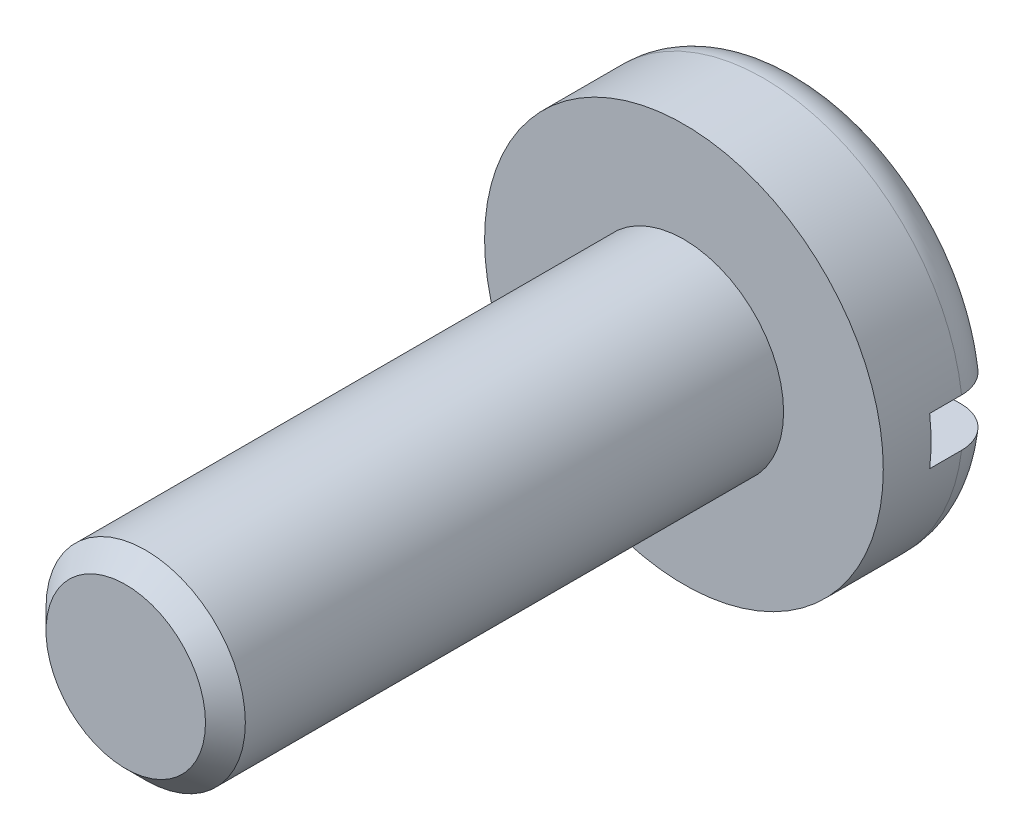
ISO-10303-21;
HEADER;
FILE_DESCRIPTION(('STEP AP214'),'2;1');
FILE_NAME('part.step','',(''),(''),'','','');
FILE_SCHEMA(('AUTOMOTIVE_DESIGN { 1 0 10303 214 1 1 1 1 }'));
ENDSEC;
DATA;
#1=APPLICATION_CONTEXT('core data for automotive mechanical design processes');
#2=APPLICATION_PROTOCOL_DEFINITION('international standard','automotive_design',2000,#1);
#3=PRODUCT_CONTEXT('',#1,'mechanical');
#4=PRODUCT('Part','Part','',(#3));
#5=PRODUCT_RELATED_PRODUCT_CATEGORY('part','',(#4));
#6=PRODUCT_DEFINITION_FORMATION('','',#4);
#7=PRODUCT_DEFINITION_CONTEXT('part definition',#1,'design');
#8=PRODUCT_DEFINITION('design','',#6,#7);
#9=PRODUCT_DEFINITION_SHAPE('','',#8);
#10=(LENGTH_UNIT() NAMED_UNIT(*) SI_UNIT(.MILLI.,.METRE.));
#11=(NAMED_UNIT(*) PLANE_ANGLE_UNIT() SI_UNIT($,.RADIAN.));
#12=(NAMED_UNIT(*) SI_UNIT($,.STERADIAN.) SOLID_ANGLE_UNIT());
#13=UNCERTAINTY_MEASURE_WITH_UNIT(LENGTH_MEASURE(1.E-05),#10,'distance_accuracy_value','');
#14=(GEOMETRIC_REPRESENTATION_CONTEXT(3) GLOBAL_UNCERTAINTY_ASSIGNED_CONTEXT((#13)) GLOBAL_UNIT_ASSIGNED_CONTEXT((#10,
#11,#12)) REPRESENTATION_CONTEXT('',''));
#15=CARTESIAN_POINT('',(0.,0.,0.));
#16=DIRECTION('',(0.,0.,1.));
#17=DIRECTION('',(1.,0.,0.));
#18=AXIS2_PLACEMENT_3D('',#15,#16,#17);
#19=CARTESIAN_POINT('',(0.,0.,-1.49999999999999));
#20=DIRECTION('',(0.,0.,1.));
#21=DIRECTION('',(1.,0.,0.));
#22=AXIS2_PLACEMENT_3D('',#19,#20,#21);
#23=PLANE('',#22);
#24=DIRECTION('',(1.,0.,0.));
#25=VECTOR('',#24,1.);
#26=CARTESIAN_POINT('',(-2.50000000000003,-0.299999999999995,-1.50000000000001));
#27=LINE('',#26,#25);
#28=CARTESIAN_POINT('',(-1.97737199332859,-0.300000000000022,-1.5));
#29=VERTEX_POINT('',#28);
#30=CARTESIAN_POINT('',(1.97737199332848,-0.300000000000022,-1.50000000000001));
#31=VERTEX_POINT('',#30);
#32=EDGE_CURVE('E159',#29,#31,#27,.T.);
#33=ORIENTED_EDGE('',*,*,#32,.T.);
#34=CARTESIAN_POINT('',(0.,0.,-1.49999999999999));
#35=DIRECTION('',(0.,0.,-1.));
#36=DIRECTION('',(-1.,0.,0.));
#37=AXIS2_PLACEMENT_3D('',#34,#35,#36);
#38=CIRCLE('',#37,2.);
#39=EDGE_CURVE('E111',#31,#29,#38,.T.);
#40=ORIENTED_EDGE('',*,*,#39,.T.);
#41=EDGE_LOOP('',(#33,#40));
#42=FACE_BOUND('',#41,.T.);
#43=ADVANCED_FACE('F30',(#42),#23,.F.);
#44=DIRECTION('',(-1.,0.,0.));
#45=VECTOR('',#44,1.);
#46=CARTESIAN_POINT('',(-2.5,0.299999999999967,-1.49999999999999));
#47=LINE('',#46,#45);
#48=CARTESIAN_POINT('',(1.97737199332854,0.299999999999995,-1.5));
#49=VERTEX_POINT('',#48);
#50=CARTESIAN_POINT('',(-1.97737199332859,0.299999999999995,-1.5));
#51=VERTEX_POINT('',#50);
#52=EDGE_CURVE('E96',#49,#51,#47,.T.);
#53=ORIENTED_EDGE('',*,*,#52,.T.);
#54=EDGE_CURVE('E107',#51,#49,#38,.T.);
#55=ORIENTED_EDGE('',*,*,#54,.T.);
#56=EDGE_LOOP('',(#53,#55));
#57=FACE_BOUND('',#56,.T.);
#58=ADVANCED_FACE('F153',(#57),#23,.F.);
#59=CARTESIAN_POINT('',(0.,0.,-1.));
#60=DIRECTION('',(0.,0.,-1.));
#61=DIRECTION('',(-1.,0.,0.));
#62=AXIS2_PLACEMENT_3D('',#59,#60,#61);
#63=TOROIDAL_SURFACE('',#62,2.,0.5);
#64=CARTESIAN_POINT('',(-2.39275623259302,-0.300000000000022,-1.28403566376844));
#65=CARTESIAN_POINT('',(-2.40871742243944,-0.300000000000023,-1.26108979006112));
#66=CARTESIAN_POINT('',(-2.42275912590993,-0.300000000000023,-1.23678491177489));
#67=CARTESIAN_POINT('',(-2.44657688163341,-0.300000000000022,-1.18614419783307));
#68=CARTESIAN_POINT('',(-2.45634810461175,-0.300000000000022,-1.15980610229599));
#69=CARTESIAN_POINT('',(-2.47132091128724,-0.300000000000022,-1.10586746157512));
#70=CARTESIAN_POINT('',(-2.47652391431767,-0.300000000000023,-1.07826731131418));
#71=CARTESIAN_POINT('',(-2.4822090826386,-0.300000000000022,-1.02259204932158));
#72=CARTESIAN_POINT('',(-2.48269236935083,-0.300000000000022,-0.994517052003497));
#73=CARTESIAN_POINT('',(-2.47893141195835,-0.300000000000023,-0.938745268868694));
#74=CARTESIAN_POINT('',(-2.47469714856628,-0.300000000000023,-0.911047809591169));
#75=CARTESIAN_POINT('',(-2.46164113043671,-0.300000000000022,-0.856755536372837));
#76=CARTESIAN_POINT('',(-2.45281923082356,-0.300000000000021,-0.830160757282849));
#77=CARTESIAN_POINT('',(-2.43083915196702,-0.300000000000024,-0.77880928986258));
#78=CARTESIAN_POINT('',(-2.41767832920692,-0.30000000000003,-0.754053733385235));
#79=CARTESIAN_POINT('',(-2.38740458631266,-0.300000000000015,-0.707090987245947));
#80=CARTESIAN_POINT('',(-2.37029161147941,-0.299999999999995,-0.684883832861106));
#81=CARTESIAN_POINT('',(-2.33252347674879,-0.299999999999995,-0.643540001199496));
#82=CARTESIAN_POINT('',(-2.31185310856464,-0.300000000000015,-0.624417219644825));
#83=CARTESIAN_POINT('',(-2.26761601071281,-0.30000000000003,-0.589882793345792));
#84=CARTESIAN_POINT('',(-2.24404918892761,-0.300000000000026,-0.574471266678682));
#85=CARTESIAN_POINT('',(-2.19450129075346,-0.300000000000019,-0.547670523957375));
#86=CARTESIAN_POINT('',(-2.16850345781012,-0.300000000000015,-0.536312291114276));
#87=CARTESIAN_POINT('',(-2.11498123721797,-0.30000000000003,-0.518077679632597));
#88=CARTESIAN_POINT('',(-2.08745677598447,-0.300000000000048,-0.511201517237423));
#89=CARTESIAN_POINT('',(-2.03139586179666,-0.300000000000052,-0.502061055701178));
#90=CARTESIAN_POINT('',(-2.00285249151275,-0.300000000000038,-0.499839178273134));
#91=CARTESIAN_POINT('',(-1.94579410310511,-0.300000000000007,-0.500178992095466));
#92=CARTESIAN_POINT('',(-1.91727908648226,-0.299999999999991,-0.502740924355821));
#93=CARTESIAN_POINT('',(-1.86085138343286,-0.299999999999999,-0.512606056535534));
#94=CARTESIAN_POINT('',(-1.83294512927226,-0.300000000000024,-0.519946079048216));
#95=CARTESIAN_POINT('',(-1.77875489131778,-0.300000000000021,-0.539195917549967));
#96=CARTESIAN_POINT('',(-1.75247096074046,-0.299999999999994,-0.551105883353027));
#97=CARTESIAN_POINT('',(-1.70222054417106,-0.299999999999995,-0.579200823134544));
#98=CARTESIAN_POINT('',(-1.67825918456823,-0.300000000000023,-0.59539497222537));
#99=CARTESIAN_POINT('',(-1.63342077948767,-0.300000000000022,-0.631604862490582));
#100=CARTESIAN_POINT('',(-1.6125436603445,-0.299999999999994,-0.651620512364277));
#101=CARTESIAN_POINT('',(-1.57465426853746,-0.299999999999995,-0.694753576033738));
#102=CARTESIAN_POINT('',(-1.55761348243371,-0.300000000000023,-0.717845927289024));
#103=CARTESIAN_POINT('',(-1.52772834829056,-0.300000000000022,-0.766603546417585));
#104=CARTESIAN_POINT('',(-1.51488357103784,-0.299999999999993,-0.792268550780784));
#105=CARTESIAN_POINT('',(-1.49398926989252,-0.299999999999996,-0.844983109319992));
#106=CARTESIAN_POINT('',(-1.48586286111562,-0.300000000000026,-0.872002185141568));
#107=CARTESIAN_POINT('',(-1.47434461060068,-0.300000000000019,-0.927030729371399));
#108=CARTESIAN_POINT('',(-1.47095224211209,-0.299999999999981,-0.95504008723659));
#109=CARTESIAN_POINT('',(-1.46903184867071,-0.299999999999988,-1.01077570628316));
#110=CARTESIAN_POINT('',(-1.47042704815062,-0.300000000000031,-1.03849935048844));
#111=CARTESIAN_POINT('',(-1.47786557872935,-0.300000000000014,-1.09331475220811));
#112=CARTESIAN_POINT('',(-1.48390879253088,-0.299999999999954,-1.12040652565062));
#113=CARTESIAN_POINT('',(-1.50042579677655,-0.299999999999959,-1.17312973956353));
#114=CARTESIAN_POINT('',(-1.51088885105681,-0.300000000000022,-1.19876454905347));
#115=CARTESIAN_POINT('',(-1.53591625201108,-0.300000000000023,-1.24794598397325));
#116=CARTESIAN_POINT('',(-1.55048084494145,-0.29999999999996,-1.27149248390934));
#117=CARTESIAN_POINT('',(-1.58348986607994,-0.299999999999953,-1.31616342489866));
#118=CARTESIAN_POINT('',(-1.60198226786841,-0.300000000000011,-1.33725240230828));
#119=CARTESIAN_POINT('',(-1.64218916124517,-0.300000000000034,-1.37609462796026));
#120=CARTESIAN_POINT('',(-1.66390395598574,-0.3,-1.39384756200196));
#121=CARTESIAN_POINT('',(-1.71035693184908,-0.299999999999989,-1.4258412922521));
#122=CARTESIAN_POINT('',(-1.7351420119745,-0.300000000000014,-1.4400140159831));
#123=CARTESIAN_POINT('',(-1.78672025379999,-0.300000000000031,-1.46405146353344));
#124=CARTESIAN_POINT('',(-1.81351355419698,-0.300000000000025,-1.4739158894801));
#125=CARTESIAN_POINT('',(-1.86867354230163,-0.30000000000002,-1.489154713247));
#126=CARTESIAN_POINT('',(-1.8970545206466,-0.300000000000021,-1.494477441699));
#127=CARTESIAN_POINT('',(-1.95430672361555,-0.300000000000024,-1.50028825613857));
#128=CARTESIAN_POINT('',(-1.98317793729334,-0.300000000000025,-1.50077644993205));
#129=CARTESIAN_POINT('',(-2.04061759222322,-0.30000000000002,-1.49688950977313));
#130=CARTESIAN_POINT('',(-2.06918574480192,-0.300000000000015,-1.492510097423));
#131=CARTESIAN_POINT('',(-2.12517926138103,-0.30000000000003,-1.47898432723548));
#132=CARTESIAN_POINT('',(-2.1526043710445,-0.30000000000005,-1.46983691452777));
#133=CARTESIAN_POINT('',(-2.20534590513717,-0.30000000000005,-1.44708782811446));
#134=CARTESIAN_POINT('',(-2.23067381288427,-0.30000000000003,-1.43351274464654));
#135=CARTESIAN_POINT('',(-2.27863868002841,-0.300000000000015,-1.4022736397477));
#136=CARTESIAN_POINT('',(-2.30127897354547,-0.300000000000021,-1.38461476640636));
#137=CARTESIAN_POINT('',(-2.33540475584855,-0.300000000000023,-1.35296400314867));
#138=CARTESIAN_POINT('',(-2.34790755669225,-0.300000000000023,-1.34005040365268));
#139=CARTESIAN_POINT('',(-2.37145637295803,-0.300000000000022,-1.31295671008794));
#140=CARTESIAN_POINT('',(-2.38250239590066,-0.300000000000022,-1.29877662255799));
#141=CARTESIAN_POINT('',(-2.39275623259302,-0.300000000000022,-1.28403566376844));
#142=B_SPLINE_CURVE_WITH_KNOTS('',3,(#64,#65,#66,#67,#68,#69,#70,#71,#72,#73,#74,#75,#76,#77,
#78,#79,#80,#81,#82,#83,#84,#85,#86,#87,#88,#89,#90,#91,#92,#93,#94,#95,#96,#97,#98,#99,#100,
#101,#102,#103,#104,#105,#106,#107,#108,#109,#110,#111,#112,#113,#114,#115,#116,#117,#118,#119,
#120,#121,#122,#123,#124,#125,#126,#127,#128,#129,#130,#131,#132,#133,#134,#135,#136,#137,#138,
#139,#140,#141),.UNSPECIFIED.,.T.,.F.,(4,2,2,2,2,2,2,2,2,2,2,2,2,2,2,2,2,2,2,2,2,2,2,2,2,2,2,2,
2,2,2,2,2,2,2,2,2,2,4),(0.,0.0837885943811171,0.16767169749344,0.251528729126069,
0.335365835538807,0.419025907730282,0.502688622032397,0.586402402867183,0.670117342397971,
0.754199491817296,0.83828431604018,0.922998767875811,1.00771730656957,1.09320471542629,
1.17869643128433,1.26485492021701,1.3510162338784,1.43736358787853,1.52370887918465,
1.60938950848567,1.69506137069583,1.77929492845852,1.86351911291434,1.9463989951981,
2.0292767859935,2.11195440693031,2.19463699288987,2.27839438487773,2.36215966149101,
2.44741457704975,2.5326753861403,2.61889371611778,2.70511012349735,2.79140237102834,
2.87771371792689,2.96351598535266,3.0492106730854,3.10303867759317,3.15686640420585),.UNSPECIFIED.);
#143=CARTESIAN_POINT('',(-2.48193472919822,-0.300000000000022,-1.00000000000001));
#144=VERTEX_POINT('',#143);
#145=EDGE_CURVE('E51',#29,#144,#142,.T.);
#146=ORIENTED_EDGE('',*,*,#145,.F.);
#147=ORIENTED_EDGE('',*,*,#39,.F.);
#148=CARTESIAN_POINT('',(1.51295371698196,-0.299999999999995,-1.20152293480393));
#149=CARTESIAN_POINT('',(1.50164195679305,-0.299999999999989,-1.1763253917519));
#150=CARTESIAN_POINT('',(1.49243193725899,-0.300000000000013,-1.15016423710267));
#151=CARTESIAN_POINT('',(1.47852371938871,-0.300000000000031,-1.09664823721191));
#152=CARTESIAN_POINT('',(1.47383003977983,-0.300000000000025,-1.06929222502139));
#153=CARTESIAN_POINT('',(1.46911958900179,-0.30000000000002,-1.01418191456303));
#154=CARTESIAN_POINT('',(1.46910208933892,-0.300000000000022,-0.986427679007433));
#155=CARTESIAN_POINT('',(1.47374385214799,-0.300000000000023,-0.93132004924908));
#156=CARTESIAN_POINT('',(1.47840213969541,-0.300000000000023,-0.903966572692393));
#157=CARTESIAN_POINT('',(1.4922206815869,-0.300000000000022,-0.850505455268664));
#158=CARTESIAN_POINT('',(1.50136823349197,-0.300000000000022,-0.824394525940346));
#159=CARTESIAN_POINT('',(1.52387003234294,-0.300000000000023,-0.774053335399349));
#160=CARTESIAN_POINT('',(1.53722462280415,-0.300000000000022,-0.74982322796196));
#161=CARTESIAN_POINT('',(1.56790637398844,-0.300000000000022,-0.703634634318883));
#162=CARTESIAN_POINT('',(1.58527611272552,-0.300000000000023,-0.6817044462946));
#163=CARTESIAN_POINT('',(1.62339117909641,-0.300000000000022,-0.641006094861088));
#164=CARTESIAN_POINT('',(1.64413681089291,-0.300000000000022,-0.622238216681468));
#165=CARTESIAN_POINT('',(1.68881591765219,-0.300000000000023,-0.588044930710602));
#166=CARTESIAN_POINT('',(1.7127998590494,-0.300000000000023,-0.572685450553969));
#167=CARTESIAN_POINT('',(1.76298083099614,-0.300000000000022,-0.546151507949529));
#168=CARTESIAN_POINT('',(1.78917802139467,-0.300000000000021,-0.534977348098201));
#169=CARTESIAN_POINT('',(1.84340132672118,-0.300000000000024,-0.516999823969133));
#170=CARTESIAN_POINT('',(1.8714463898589,-0.30000000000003,-0.510253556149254));
#171=CARTESIAN_POINT('',(1.92827077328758,-0.300000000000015,-0.501551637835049));
#172=CARTESIAN_POINT('',(1.95705011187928,-0.299999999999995,-0.499596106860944));
#173=CARTESIAN_POINT('',(2.01460044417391,-0.299999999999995,-0.50054361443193));
#174=CARTESIAN_POINT('',(2.04337124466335,-0.300000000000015,-0.503458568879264));
#175=CARTESIAN_POINT('',(2.10000814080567,-0.30000000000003,-0.514104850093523));
#176=CARTESIAN_POINT('',(2.12787425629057,-0.300000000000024,-0.521836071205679));
#177=CARTESIAN_POINT('',(2.18174184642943,-0.300000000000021,-0.541856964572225));
#178=CARTESIAN_POINT('',(2.20775283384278,-0.300000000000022,-0.554121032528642));
#179=CARTESIAN_POINT('',(2.25732057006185,-0.300000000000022,-0.582880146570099));
#180=CARTESIAN_POINT('',(2.28087742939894,-0.300000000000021,-0.599375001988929));
#181=CARTESIAN_POINT('',(2.32464265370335,-0.300000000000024,-0.635969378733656));
#182=CARTESIAN_POINT('',(2.34487911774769,-0.30000000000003,-0.65603529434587));
#183=CARTESIAN_POINT('',(2.38166035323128,-0.300000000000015,-0.69930552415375));
#184=CARTESIAN_POINT('',(2.39820529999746,-0.299999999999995,-0.722509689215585));
#185=CARTESIAN_POINT('',(2.42698667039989,-0.299999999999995,-0.771182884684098));
#186=CARTESIAN_POINT('',(2.43925877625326,-0.300000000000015,-0.796630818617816));
#187=CARTESIAN_POINT('',(2.45932706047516,-0.30000000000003,-0.849234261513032));
#188=CARTESIAN_POINT('',(2.46712340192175,-0.300000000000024,-0.876389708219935));
#189=CARTESIAN_POINT('',(2.47797597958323,-0.300000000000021,-0.931462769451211));
#190=CARTESIAN_POINT('',(2.4810602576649,-0.300000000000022,-0.959374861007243));
#191=CARTESIAN_POINT('',(2.4824866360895,-0.300000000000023,-1.01531971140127));
#192=CARTESIAN_POINT('',(2.4808288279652,-0.300000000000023,-1.04335246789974));
#193=CARTESIAN_POINT('',(2.47282971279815,-0.300000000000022,-1.09867291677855));
#194=CARTESIAN_POINT('',(2.46649956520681,-0.300000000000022,-1.12596222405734));
#195=CARTESIAN_POINT('',(2.44935421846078,-0.300000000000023,-1.17909306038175));
#196=CARTESIAN_POINT('',(2.43853901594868,-0.300000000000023,-1.20493458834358));
#197=CARTESIAN_POINT('',(2.41271934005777,-0.300000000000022,-1.25448123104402));
#198=CARTESIAN_POINT('',(2.39770859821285,-0.300000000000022,-1.27818307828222));
#199=CARTESIAN_POINT('',(2.36394008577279,-0.300000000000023,-1.3227466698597));
#200=CARTESIAN_POINT('',(2.34518224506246,-0.300000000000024,-1.34360836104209));
#201=CARTESIAN_POINT('',(2.30435220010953,-0.300000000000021,-1.38201875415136));
#202=CARTESIAN_POINT('',(2.2822633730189,-0.300000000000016,-1.39954978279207));
#203=CARTESIAN_POINT('',(2.23547558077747,-0.300000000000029,-1.43068910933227));
#204=CARTESIAN_POINT('',(2.21077651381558,-0.300000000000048,-1.44429725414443));
#205=CARTESIAN_POINT('',(2.15925900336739,-0.300000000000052,-1.46732332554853));
#206=CARTESIAN_POINT('',(2.13242515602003,-0.300000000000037,-1.47670678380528));
#207=CARTESIAN_POINT('',(2.07757090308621,-0.300000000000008,-1.4908805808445));
#208=CARTESIAN_POINT('',(2.04955043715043,-0.299999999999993,-1.49567068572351));
#209=CARTESIAN_POINT('',(1.99284573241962,-0.299999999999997,-1.50056541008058));
#210=CARTESIAN_POINT('',(1.96415777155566,-0.300000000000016,-1.50062692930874));
#211=CARTESIAN_POINT('',(1.9071734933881,-0.300000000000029,-1.49596835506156));
#212=CARTESIAN_POINT('',(1.87887718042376,-0.300000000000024,-1.4912482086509));
#213=CARTESIAN_POINT('',(1.82327468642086,-0.300000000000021,-1.47711555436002));
#214=CARTESIAN_POINT('',(1.79597660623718,-0.300000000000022,-1.46767115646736));
#215=CARTESIAN_POINT('',(1.74334396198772,-0.300000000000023,-1.44433233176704));
#216=CARTESIAN_POINT('',(1.71800992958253,-0.300000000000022,-1.43043670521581));
#217=CARTESIAN_POINT('',(1.67002830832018,-0.300000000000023,-1.39856652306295));
#218=CARTESIAN_POINT('',(1.64738261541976,-0.300000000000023,-1.38058911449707));
#219=CARTESIAN_POINT('',(1.60549029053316,-0.300000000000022,-1.34106460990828));
#220=CARTESIAN_POINT('',(1.586239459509,-0.300000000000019,-1.31952198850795));
#221=CARTESIAN_POINT('',(1.55792919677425,-0.300000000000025,-1.28177033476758));
#222=CARTESIAN_POINT('',(1.54769403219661,-0.300000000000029,-1.26642830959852));
#223=CARTESIAN_POINT('',(1.52897880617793,-0.300000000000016,-1.2347080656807));
#224=CARTESIAN_POINT('',(1.52049873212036,-0.299999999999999,-1.2183298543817));
#225=CARTESIAN_POINT('',(1.51295371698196,-0.299999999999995,-1.20152293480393));
#226=B_SPLINE_CURVE_WITH_KNOTS('',3,(#148,#149,#150,#151,#152,#153,#154,#155,#156,#157,#158,
#159,#160,#161,#162,#163,#164,#165,#166,#167,#168,#169,#170,#171,#172,#173,#174,#175,#176,#177,
#178,#179,#180,#181,#182,#183,#184,#185,#186,#187,#188,#189,#190,#191,#192,#193,#194,#195,#196,
#197,#198,#199,#200,#201,#202,#203,#204,#205,#206,#207,#208,#209,#210,#211,#212,#213,#214,#215,
#216,#217,#218,#219,#220,#221,#222,#223,#224,#225),.UNSPECIFIED.,.T.,.F.,(4,2,2,2,2,2,2,2,2,2,2,
2,2,2,2,2,2,2,2,2,2,2,2,2,2,2,2,2,2,2,2,2,2,2,2,2,2,2,4),(0.,0.0827941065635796,
0.165670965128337,0.24853491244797,0.331381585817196,0.413995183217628,0.496615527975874,
0.580155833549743,0.663703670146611,0.748748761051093,0.833799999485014,0.919927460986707,
1.00605707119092,1.09239771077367,1.17873645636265,1.26459478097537,1.35044923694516,
1.43553479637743,1.52061631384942,1.60496924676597,1.68931910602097,1.77316500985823,
1.85700929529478,1.940653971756,2.02429871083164,2.10806909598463,2.19184104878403,
2.27604580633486,2.36025384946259,2.44513700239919,2.53002447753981,2.61568559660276,
2.7013476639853,2.78759593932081,2.87386748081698,2.96019950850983,3.04642399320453,
3.10164857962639,3.15687276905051),.UNSPECIFIED.);
#227=CARTESIAN_POINT('',(2.48193472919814,-0.299999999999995,-1.00000000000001));
#228=VERTEX_POINT('',#227);
#229=EDGE_CURVE('E123',#228,#31,#226,.T.);
#230=ORIENTED_EDGE('',*,*,#229,.F.);
#231=CARTESIAN_POINT('',(0.,0.,-1.));
#232=DIRECTION('',(0.,0.,-1.));
#233=DIRECTION('',(-1.,0.,0.));
#234=AXIS2_PLACEMENT_3D('',#231,#232,#233);
#235=CIRCLE('',#234,2.5);
#236=EDGE_CURVE('E118',#228,#144,#235,.T.);
#237=ORIENTED_EDGE('',*,*,#236,.T.);
#238=EDGE_LOOP('',(#146,#147,#230,#237));
#239=FACE_BOUND('',#238,.T.);
#240=ADVANCED_FACE('F131',(#239),#63,.T.);
#241=CARTESIAN_POINT('',(-2.39275623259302,0.299999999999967,-1.28403566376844));
#242=CARTESIAN_POINT('',(-2.37663666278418,0.299999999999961,-1.30720477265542));
#243=CARTESIAN_POINT('',(-2.35853609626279,0.299999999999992,-1.3290219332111));
#244=CARTESIAN_POINT('',(-2.3189056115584,0.299999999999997,-1.36931696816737));
#245=CARTESIAN_POINT('',(-2.29737130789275,0.29999999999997,-1.38779050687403));
#246=CARTESIAN_POINT('',(-2.25152834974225,0.299999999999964,-1.42085294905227));
#247=CARTESIAN_POINT('',(-2.22722204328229,0.299999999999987,-1.43544510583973));
#248=CARTESIAN_POINT('',(-2.17652432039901,0.300000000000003,-1.46036713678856));
#249=CARTESIAN_POINT('',(-2.15013341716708,0.299999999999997,-1.47069805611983));
#250=CARTESIAN_POINT('',(-2.09582564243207,0.299999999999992,-1.48688942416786));
#251=CARTESIAN_POINT('',(-2.06789989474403,0.299999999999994,-1.49272009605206));
#252=CARTESIAN_POINT('',(-2.01146649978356,0.299999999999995,-1.49965496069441));
#253=CARTESIAN_POINT('',(-1.98295879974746,0.299999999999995,-1.50075872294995));
#254=CARTESIAN_POINT('',(-1.92590693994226,0.299999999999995,-1.49821232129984));
#255=CARTESIAN_POINT('',(-1.89736463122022,0.299999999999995,-1.49452060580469));
#256=CARTESIAN_POINT('',(-1.84129666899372,0.299999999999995,-1.48242263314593));
#257=CARTESIAN_POINT('',(-1.81377105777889,0.299999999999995,-1.47401618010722));
#258=CARTESIAN_POINT('',(-1.76037992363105,0.299999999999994,-1.45266949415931));
#259=CARTESIAN_POINT('',(-1.73452319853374,0.299999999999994,-1.43970724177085));
#260=CARTESIAN_POINT('',(-1.68536182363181,0.299999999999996,-1.40961139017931));
#261=CARTESIAN_POINT('',(-1.66205717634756,0.299999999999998,-1.39247778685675));
#262=CARTESIAN_POINT('',(-1.61876589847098,0.299999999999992,-1.35457576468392));
#263=CARTESIAN_POINT('',(-1.59876763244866,0.299999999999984,-1.33382064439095));
#264=CARTESIAN_POINT('',(-1.5625982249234,0.300000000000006,-1.28920623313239));
#265=CARTESIAN_POINT('',(-1.54642680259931,0.300000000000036,-1.26534717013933));
#266=CARTESIAN_POINT('',(-1.51862309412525,0.30000000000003,-1.2155527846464));
#267=CARTESIAN_POINT('',(-1.50693057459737,0.299999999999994,-1.18965110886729));
#268=CARTESIAN_POINT('',(-1.48815094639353,0.299999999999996,-1.1362289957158));
#269=CARTESIAN_POINT('',(-1.4810632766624,0.300000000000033,-1.10870875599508));
#270=CARTESIAN_POINT('',(-1.47181632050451,0.300000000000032,-1.05336072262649));
#271=CARTESIAN_POINT('',(-1.4695709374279,0.299999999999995,-1.02554729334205));
#272=CARTESIAN_POINT('',(-1.46982713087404,0.299999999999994,-0.969943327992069));
#273=CARTESIAN_POINT('',(-1.47232840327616,0.30000000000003,-0.942152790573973));
#274=CARTESIAN_POINT('',(-1.48195137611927,0.300000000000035,-0.887634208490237));
#275=CARTESIAN_POINT('',(-1.48903285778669,0.300000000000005,-0.860899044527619));
#276=CARTESIAN_POINT('',(-1.50754942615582,0.299999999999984,-0.80898264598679));
#277=CARTESIAN_POINT('',(-1.51898465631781,0.299999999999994,-0.783801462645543));
#278=CARTESIAN_POINT('',(-1.54596094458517,0.299999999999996,-0.735485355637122));
#279=CARTESIAN_POINT('',(-1.56153353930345,0.299999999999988,-0.712368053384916));
#280=CARTESIAN_POINT('',(-1.59627591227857,0.300000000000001,-0.66901710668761));
#281=CARTESIAN_POINT('',(-1.61544600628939,0.300000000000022,-0.648783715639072));
#282=CARTESIAN_POINT('',(-1.65719975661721,0.300000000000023,-0.611398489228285));
#283=CARTESIAN_POINT('',(-1.67983740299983,0.300000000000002,-0.594306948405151));
#284=CARTESIAN_POINT('',(-1.72762667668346,0.299999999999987,-0.564101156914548));
#285=CARTESIAN_POINT('',(-1.75277850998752,0.299999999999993,-0.550987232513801));
#286=CARTESIAN_POINT('',(-1.80528190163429,0.299999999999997,-0.528921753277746));
#287=CARTESIAN_POINT('',(-1.8326602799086,0.299999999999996,-0.520033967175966));
#288=CARTESIAN_POINT('',(-1.88851740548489,0.299999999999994,-0.50695554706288));
#289=CARTESIAN_POINT('',(-1.9169961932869,0.299999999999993,-0.502765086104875));
#290=CARTESIAN_POINT('',(-1.97439273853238,0.299999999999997,-0.499197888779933));
#291=CARTESIAN_POINT('',(-2.00331194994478,0.300000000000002,-0.499844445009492));
#292=CARTESIAN_POINT('',(-2.06062804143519,0.299999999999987,-0.506003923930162));
#293=CARTESIAN_POINT('',(-2.08902492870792,0.299999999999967,-0.511516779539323));
#294=CARTESIAN_POINT('',(-2.1443626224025,0.299999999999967,-0.527238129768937));
#295=CARTESIAN_POINT('',(-2.17130892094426,0.299999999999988,-0.537427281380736));
#296=CARTESIAN_POINT('',(-2.22308657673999,0.300000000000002,-0.562223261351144));
#297=CARTESIAN_POINT('',(-2.24791801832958,0.299999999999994,-0.576829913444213));
#298=CARTESIAN_POINT('',(-2.29453266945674,0.299999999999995,-0.609913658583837));
#299=CARTESIAN_POINT('',(-2.31634016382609,0.300000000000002,-0.628356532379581));
#300=CARTESIAN_POINT('',(-2.35651448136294,0.299999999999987,-0.668671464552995));
#301=CARTESIAN_POINT('',(-2.37488146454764,0.299999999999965,-0.690543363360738));
#302=CARTESIAN_POINT('',(-2.4074821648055,0.299999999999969,-0.736885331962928));
#303=CARTESIAN_POINT('',(-2.42175116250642,0.299999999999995,-0.76133058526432));
#304=CARTESIAN_POINT('',(-2.4459499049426,0.299999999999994,-0.812280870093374));
#305=CARTESIAN_POINT('',(-2.45587999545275,0.299999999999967,-0.838785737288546));
#306=CARTESIAN_POINT('',(-2.47105459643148,0.299999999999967,-0.892909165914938));
#307=CARTESIAN_POINT('',(-2.4763305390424,0.299999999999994,-0.920518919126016));
#308=CARTESIAN_POINT('',(-2.48215636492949,0.299999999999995,-0.976240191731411));
#309=CARTESIAN_POINT('',(-2.48270516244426,0.299999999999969,-1.00435182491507));
#310=CARTESIAN_POINT('',(-2.4790644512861,0.299999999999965,-1.06018488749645));
#311=CARTESIAN_POINT('',(-2.47488810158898,0.299999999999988,-1.08790718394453));
#312=CARTESIAN_POINT('',(-2.46194244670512,0.300000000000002,-1.14223280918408));
#313=CARTESIAN_POINT('',(-2.45317878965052,0.299999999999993,-1.16883747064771));
#314=CARTESIAN_POINT('',(-2.4355727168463,0.299999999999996,-1.21022598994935));
#315=CARTESIAN_POINT('',(-2.42807592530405,0.300000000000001,-1.22559659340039));
#316=CARTESIAN_POINT('',(-2.41154682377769,0.299999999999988,-1.25548850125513));
#317=CARTESIAN_POINT('',(-2.40251451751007,0.299999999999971,-1.27000980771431));
#318=CARTESIAN_POINT('',(-2.39275623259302,0.299999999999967,-1.28403566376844));
#319=B_SPLINE_CURVE_WITH_KNOTS('',3,(#241,#242,#243,#244,#245,#246,#247,#248,#249,#250,#251,
#252,#253,#254,#255,#256,#257,#258,#259,#260,#261,#262,#263,#264,#265,#266,#267,#268,#269,#270,
#271,#272,#273,#274,#275,#276,#277,#278,#279,#280,#281,#282,#283,#284,#285,#286,#287,#288,#289,
#290,#291,#292,#293,#294,#295,#296,#297,#298,#299,#300,#301,#302,#303,#304,#305,#306,#307,#308,
#309,#310,#311,#312,#313,#314,#315,#316,#317,#318),.UNSPECIFIED.,.T.,.F.,(4,2,2,2,2,2,2,2,2,2,2,
2,2,2,2,2,2,2,2,2,2,2,2,2,2,2,2,2,2,2,2,2,2,2,2,2,2,2,4),(0.,0.0846118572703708,
0.169332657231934,0.25398222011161,0.33861100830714,0.423795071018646,0.508986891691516,
0.594921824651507,0.680860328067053,0.76722004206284,0.853579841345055,0.939628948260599,
1.02567173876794,1.11051298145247,1.19534388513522,1.27865360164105,1.36195798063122,
1.44454061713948,1.52712597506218,1.6103598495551,1.69360103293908,1.77830268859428,
1.86301129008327,1.94896041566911,2.034912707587,2.12127916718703,2.20764443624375,
2.29365564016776,2.37966341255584,2.46493458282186,2.55020178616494,2.6347112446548,
2.71921396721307,2.80314152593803,2.8870883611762,2.97080198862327,3.05441278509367,
3.10563428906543,3.15685566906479),.UNSPECIFIED.);
#320=CARTESIAN_POINT('',(-2.48193472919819,0.299999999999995,-1.));
#321=VERTEX_POINT('',#320);
#322=EDGE_CURVE('E164',#321,#51,#319,.T.);
#323=ORIENTED_EDGE('',*,*,#322,.F.);
#324=CARTESIAN_POINT('',(2.48193472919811,0.299999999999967,-0.999999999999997));
#325=VERTEX_POINT('',#324);
#326=EDGE_CURVE('E116',#321,#325,#235,.T.);
#327=ORIENTED_EDGE('',*,*,#326,.T.);
#328=CARTESIAN_POINT('',(1.51295371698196,0.299999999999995,-1.20152293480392));
#329=CARTESIAN_POINT('',(1.524527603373,0.299999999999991,-1.22729808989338));
#330=CARTESIAN_POINT('',(1.53831827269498,0.299999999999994,-1.25210269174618));
#331=CARTESIAN_POINT('',(1.56989783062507,0.299999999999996,-1.29905284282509));
#332=CARTESIAN_POINT('',(1.58769235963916,0.299999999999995,-1.32119457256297));
#333=CARTESIAN_POINT('',(1.62670934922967,0.299999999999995,-1.36216736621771));
#334=CARTESIAN_POINT('',(1.64792762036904,0.299999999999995,-1.38100241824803));
#335=CARTESIAN_POINT('',(1.69318518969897,0.299999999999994,-1.41488822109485));
#336=CARTESIAN_POINT('',(1.71722377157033,0.299999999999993,-1.42993992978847));
#337=CARTESIAN_POINT('',(1.76775652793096,0.299999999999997,-1.45602798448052));
#338=CARTESIAN_POINT('',(1.79427671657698,0.300000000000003,-1.46701395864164));
#339=CARTESIAN_POINT('',(1.84877824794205,0.299999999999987,-1.48441559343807));
#340=CARTESIAN_POINT('',(1.87675972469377,0.299999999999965,-1.49083083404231));
#341=CARTESIAN_POINT('',(1.93360878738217,0.299999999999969,-1.49893788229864));
#342=CARTESIAN_POINT('',(1.96248135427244,0.299999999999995,-1.50059483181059));
#343=CARTESIAN_POINT('',(2.02009421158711,0.299999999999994,-1.49902645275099));
#344=CARTESIAN_POINT('',(2.04883450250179,0.299999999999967,-1.4958011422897));
#345=CARTESIAN_POINT('',(2.10529197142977,0.299999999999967,-1.48455545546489));
#346=CARTESIAN_POINT('',(2.13301139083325,0.299999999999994,-1.47654634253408));
#347=CARTESIAN_POINT('',(2.18669482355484,0.299999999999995,-1.45595107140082));
#348=CARTESIAN_POINT('',(2.21265890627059,0.299999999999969,-1.44336509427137));
#349=CARTESIAN_POINT('',(2.26187268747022,0.299999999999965,-1.41407728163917));
#350=CARTESIAN_POINT('',(2.2851422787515,0.299999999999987,-1.39740887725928));
#351=CARTESIAN_POINT('',(2.32851967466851,0.300000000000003,-1.36036870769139));
#352=CARTESIAN_POINT('',(2.34862762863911,0.299999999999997,-1.33999711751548));
#353=CARTESIAN_POINT('',(2.38491736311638,0.299999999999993,-1.29632933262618));
#354=CARTESIAN_POINT('',(2.40113325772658,0.299999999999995,-1.27306148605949));
#355=CARTESIAN_POINT('',(2.42939438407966,0.299999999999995,-1.22411745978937));
#356=CARTESIAN_POINT('',(2.44143979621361,0.299999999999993,-1.19844138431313));
#357=CARTESIAN_POINT('',(2.46092908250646,0.299999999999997,-1.14561409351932));
#358=CARTESIAN_POINT('',(2.46840622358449,0.300000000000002,-1.11847514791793));
#359=CARTESIAN_POINT('',(2.47867699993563,0.299999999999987,-1.06332515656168));
#360=CARTESIAN_POINT('',(2.48147076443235,0.299999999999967,-1.03531413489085));
#361=CARTESIAN_POINT('',(2.48229055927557,0.299999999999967,-0.97933878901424));
#362=CARTESIAN_POINT('',(2.48033625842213,0.299999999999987,-0.951374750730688));
#363=CARTESIAN_POINT('',(2.4717586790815,0.300000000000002,-0.896172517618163));
#364=CARTESIAN_POINT('',(2.46513544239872,0.299999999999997,-0.868934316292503));
#365=CARTESIAN_POINT('',(2.44741716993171,0.299999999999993,-0.815963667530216));
#366=CARTESIAN_POINT('',(2.43632356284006,0.299999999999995,-0.790230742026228));
#367=CARTESIAN_POINT('',(2.40998810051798,0.299999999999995,-0.740983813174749));
#368=CARTESIAN_POINT('',(2.39474620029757,0.299999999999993,-0.717469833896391));
#369=CARTESIAN_POINT('',(2.36049462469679,0.299999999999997,-0.673236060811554));
#370=CARTESIAN_POINT('',(2.34147191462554,0.300000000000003,-0.652526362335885));
#371=CARTESIAN_POINT('',(2.30024067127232,0.299999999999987,-0.614568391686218));
#372=CARTESIAN_POINT('',(2.27803204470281,0.299999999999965,-0.59732022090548));
#373=CARTESIAN_POINT('',(2.23089955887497,0.299999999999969,-0.56664546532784));
#374=CARTESIAN_POINT('',(2.20595818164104,0.299999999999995,-0.553245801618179));
#375=CARTESIAN_POINT('',(2.15419440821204,0.299999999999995,-0.530782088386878));
#376=CARTESIAN_POINT('',(2.12737192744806,0.299999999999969,-0.521718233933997));
#377=CARTESIAN_POINT('',(2.0723527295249,0.299999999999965,-0.508097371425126));
#378=CARTESIAN_POINT('',(2.04414591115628,0.299999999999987,-0.503581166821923));
#379=CARTESIAN_POINT('',(1.98737407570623,0.300000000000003,-0.499305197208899));
#380=CARTESIAN_POINT('',(1.95880904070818,0.299999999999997,-0.499545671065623));
#381=CARTESIAN_POINT('',(1.90187459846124,0.299999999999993,-0.504785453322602));
#382=CARTESIAN_POINT('',(1.87350889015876,0.299999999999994,-0.509825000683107));
#383=CARTESIAN_POINT('',(1.81801805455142,0.299999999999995,-0.524574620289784));
#384=CARTESIAN_POINT('',(1.79089297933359,0.299999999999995,-0.534284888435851));
#385=CARTESIAN_POINT('',(1.73854574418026,0.299999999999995,-0.558156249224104));
#386=CARTESIAN_POINT('',(1.71333157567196,0.299999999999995,-0.572334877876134));
#387=CARTESIAN_POINT('',(1.6656558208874,0.299999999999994,-0.6047439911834));
#388=CARTESIAN_POINT('',(1.64319422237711,0.299999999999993,-0.622974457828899));
#389=CARTESIAN_POINT('',(1.60179845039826,0.299999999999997,-0.662886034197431));
#390=CARTESIAN_POINT('',(1.58284699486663,0.300000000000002,-0.684549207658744));
#391=CARTESIAN_POINT('',(1.54891708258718,0.299999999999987,-0.730790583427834));
#392=CARTESIAN_POINT('',(1.53393812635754,0.299999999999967,-0.755368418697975));
#393=CARTESIAN_POINT('',(1.50863022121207,0.299999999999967,-0.806344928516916));
#394=CARTESIAN_POINT('',(1.49823384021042,0.299999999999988,-0.832710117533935));
#395=CARTESIAN_POINT('',(1.48210216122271,0.300000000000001,-0.886837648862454));
#396=CARTESIAN_POINT('',(1.47636750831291,0.299999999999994,-0.91460018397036));
#397=CARTESIAN_POINT('',(1.46981262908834,0.299999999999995,-0.970217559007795));
#398=CARTESIAN_POINT('',(1.4689106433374,0.300000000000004,-0.998062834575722));
#399=CARTESIAN_POINT('',(1.47183363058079,0.299999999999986,-1.05347947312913));
#400=CARTESIAN_POINT('',(1.47565247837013,0.299999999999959,-1.08105114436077));
#401=CARTESIAN_POINT('',(1.48538142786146,0.299999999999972,-1.12413018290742));
#402=CARTESIAN_POINT('',(1.48981103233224,0.299999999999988,-1.13998694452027));
#403=CARTESIAN_POINT('',(1.5002278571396,0.300000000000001,-1.17117977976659));
#404=CARTESIAN_POINT('',(1.50621505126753,0.299999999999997,-1.18651586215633));
#405=CARTESIAN_POINT('',(1.51295371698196,0.299999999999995,-1.20152293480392));
#406=B_SPLINE_CURVE_WITH_KNOTS('',3,(#328,#329,#330,#331,#332,#333,#334,#335,#336,#337,#338,
#339,#340,#341,#342,#343,#344,#345,#346,#347,#348,#349,#350,#351,#352,#353,#354,#355,#356,#357,
#358,#359,#360,#361,#362,#363,#364,#365,#366,#367,#368,#369,#370,#371,#372,#373,#374,#375,#376,
#377,#378,#379,#380,#381,#382,#383,#384,#385,#386,#387,#388,#389,#390,#391,#392,#393,#394,#395,
#396,#397,#398,#399,#400,#401,#402,#403,#404,#405),.UNSPECIFIED.,.T.,.F.,(4,2,2,2,2,2,2,2,2,2,2,
2,2,2,2,2,2,2,2,2,2,2,2,2,2,2,2,2,2,2,2,2,2,2,2,2,2,2,4),(0.,0.0847019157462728,
0.169523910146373,0.254242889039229,0.338940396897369,0.424654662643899,0.510376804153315,
0.596725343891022,0.683073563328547,0.76921927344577,0.855361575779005,0.940820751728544,
1.02627588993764,1.11095216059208,1.19562476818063,1.27967318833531,1.36371928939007,
1.44741782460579,1.53111561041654,1.61478666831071,1.69845863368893,1.78242423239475,
1.86639229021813,1.95093416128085,2.03547983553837,2.12077750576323,2.20607945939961,
2.29210300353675,2.37813015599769,2.46449921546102,2.55086789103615,2.63679932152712,
2.7227199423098,2.80733021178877,2.89195218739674,2.97513789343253,3.05821578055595,
3.1075326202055,3.15684863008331),.UNSPECIFIED.);
#407=EDGE_CURVE('E165',#49,#325,#406,.T.);
#408=ORIENTED_EDGE('',*,*,#407,.F.);
#409=ORIENTED_EDGE('',*,*,#54,.F.);
#410=EDGE_LOOP('',(#323,#327,#408,#409));
#411=FACE_BOUND('',#410,.T.);
#412=ADVANCED_FACE('F146',(#411),#63,.T.);
#413=CARTESIAN_POINT('',(0.,0.,0.));
#414=DIRECTION('',(0.,0.,-1.));
#415=DIRECTION('',(-1.,0.,0.));
#416=AXIS2_PLACEMENT_3D('',#413,#414,#415);
#417=CYLINDRICAL_SURFACE('',#416,2.5);
#418=CARTESIAN_POINT('',(0.,0.,0.));
#419=DIRECTION('',(0.,0.,-1.));
#420=DIRECTION('',(-1.,0.,0.));
#421=AXIS2_PLACEMENT_3D('',#418,#419,#420);
#422=CIRCLE('',#421,2.5);
#423=CARTESIAN_POINT('',(-2.5,0.,0.));
#424=VERTEX_POINT('',#423);
#425=EDGE_CURVE('E120',#424,#424,#422,.T.);
#426=ORIENTED_EDGE('',*,*,#425,.T.);
#427=EDGE_LOOP('',(#426));
#428=FACE_BOUND('',#427,.T.);
#429=DIRECTION('',(0.,0.,-1.));
#430=VECTOR('',#429,1.);
#431=CARTESIAN_POINT('',(-2.48193472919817,-0.30000000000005,0.));
#432=LINE('',#431,#430);
#433=CARTESIAN_POINT('',(-2.48193472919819,-0.300000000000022,-0.599999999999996));
#434=VERTEX_POINT('',#433);
#435=EDGE_CURVE('E79',#144,#434,#432,.F.);
#436=ORIENTED_EDGE('',*,*,#435,.F.);
#437=ORIENTED_EDGE('',*,*,#236,.F.);
#438=DIRECTION('',(0.,0.,-1.));
#439=VECTOR('',#438,1.);
#440=CARTESIAN_POINT('',(2.48193472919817,-0.300000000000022,0.));
#441=LINE('',#440,#439);
#442=CARTESIAN_POINT('',(2.48193472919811,-0.300000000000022,-0.600000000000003));
#443=VERTEX_POINT('',#442);
#444=EDGE_CURVE('E44',#443,#228,#441,.T.);
#445=ORIENTED_EDGE('',*,*,#444,.F.);
#446=CARTESIAN_POINT('',(0.,0.,-0.600000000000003));
#447=DIRECTION('',(0.,0.,1.));
#448=DIRECTION('',(1.,0.,0.));
#449=AXIS2_PLACEMENT_3D('',#446,#447,#448);
#450=CIRCLE('',#449,2.5);
#451=CARTESIAN_POINT('',(2.48193472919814,0.299999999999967,-0.599999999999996));
#452=VERTEX_POINT('',#451);
#453=EDGE_CURVE('E94',#443,#452,#450,.T.);
#454=ORIENTED_EDGE('',*,*,#453,.T.);
#455=DIRECTION('',(0.,0.,-1.));
#456=VECTOR('',#455,1.);
#457=CARTESIAN_POINT('',(2.48193472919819,0.299999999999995,0.));
#458=LINE('',#457,#456);
#459=EDGE_CURVE('E103',#325,#452,#458,.F.);
#460=ORIENTED_EDGE('',*,*,#459,.F.);
#461=ORIENTED_EDGE('',*,*,#326,.F.);
#462=DIRECTION('',(0.,0.,-1.));
#463=VECTOR('',#462,1.);
#464=CARTESIAN_POINT('',(-2.48193472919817,0.299999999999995,0.));
#465=LINE('',#464,#463);
#466=CARTESIAN_POINT('',(-2.48193472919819,0.299999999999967,-0.599999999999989));
#467=VERTEX_POINT('',#466);
#468=EDGE_CURVE('E87',#467,#321,#465,.T.);
#469=ORIENTED_EDGE('',*,*,#468,.F.);
#470=EDGE_CURVE('E92',#467,#434,#450,.T.);
#471=ORIENTED_EDGE('',*,*,#470,.T.);
#472=EDGE_LOOP('',(#436,#437,#445,#454,#460,#461,#469,#471));
#473=FACE_BOUND('',#472,.T.);
#474=ADVANCED_FACE('F99',(#428,#473),#417,.T.);
#475=CARTESIAN_POINT('',(0.,0.,0.));
#476=DIRECTION('',(0.,0.,-1.));
#477=DIRECTION('',(-1.,0.,0.));
#478=AXIS2_PLACEMENT_3D('',#475,#476,#477);
#479=PLANE('',#478);
#480=CARTESIAN_POINT('',(0.,0.,0.));
#481=DIRECTION('',(0.,0.,1.));
#482=DIRECTION('',(1.,0.,0.));
#483=AXIS2_PLACEMENT_3D('',#480,#481,#482);
#484=CIRCLE('',#483,1.25);
#485=CARTESIAN_POINT('',(1.25,0.,0.));
#486=VERTEX_POINT('',#485);
#487=EDGE_CURVE('E161',#486,#486,#484,.T.);
#488=ORIENTED_EDGE('',*,*,#487,.F.);
#489=EDGE_LOOP('',(#488));
#490=FACE_BOUND('',#489,.T.);
#491=ORIENTED_EDGE('',*,*,#425,.F.);
#492=EDGE_LOOP('',(#491));
#493=FACE_BOUND('',#492,.T.);
#494=ADVANCED_FACE('F139',(#490,#493),#479,.F.);
#495=CARTESIAN_POINT('',(-2.50000000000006,-0.300000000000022,-0.599999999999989));
#496=DIRECTION('',(0.,1.,0.));
#497=DIRECTION('',(0.,0.,1.));
#498=AXIS2_PLACEMENT_3D('',#495,#496,#497);
#499=PLANE('',#498);
#500=ORIENTED_EDGE('',*,*,#229,.T.);
#501=ORIENTED_EDGE('',*,*,#32,.F.);
#502=ORIENTED_EDGE('',*,*,#145,.T.);
#503=ORIENTED_EDGE('',*,*,#435,.T.);
#504=DIRECTION('',(1.,0.,0.));
#505=VECTOR('',#504,1.);
#506=CARTESIAN_POINT('',(-2.50000000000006,-0.300000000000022,-0.599999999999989));
#507=LINE('',#506,#505);
#508=EDGE_CURVE('E82',#434,#443,#507,.T.);
#509=ORIENTED_EDGE('',*,*,#508,.T.);
#510=ORIENTED_EDGE('',*,*,#444,.T.);
#511=EDGE_LOOP('',(#500,#501,#502,#503,#509,#510));
#512=FACE_BOUND('',#511,.T.);
#513=ADVANCED_FACE('F81',(#512),#499,.T.);
#514=CARTESIAN_POINT('',(-2.50000000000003,0.299999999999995,-0.599999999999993));
#515=DIRECTION('',(0.,-1.,0.));
#516=DIRECTION('',(0.,0.,-1.));
#517=AXIS2_PLACEMENT_3D('',#514,#515,#516);
#518=PLANE('',#517);
#519=ORIENTED_EDGE('',*,*,#322,.T.);
#520=ORIENTED_EDGE('',*,*,#52,.F.);
#521=ORIENTED_EDGE('',*,*,#407,.T.);
#522=ORIENTED_EDGE('',*,*,#459,.T.);
#523=DIRECTION('',(-1.,0.,0.));
#524=VECTOR('',#523,1.);
#525=CARTESIAN_POINT('',(-2.50000000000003,0.299999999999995,-0.599999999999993));
#526=LINE('',#525,#524);
#527=EDGE_CURVE('E95',#452,#467,#526,.T.);
#528=ORIENTED_EDGE('',*,*,#527,.T.);
#529=ORIENTED_EDGE('',*,*,#468,.T.);
#530=EDGE_LOOP('',(#519,#520,#521,#522,#528,#529));
#531=FACE_BOUND('',#530,.T.);
#532=ADVANCED_FACE('F138',(#531),#518,.T.);
#533=CARTESIAN_POINT('',(-2.50000000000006,-0.300000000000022,-0.599999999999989));
#534=DIRECTION('',(0.,0.,1.));
#535=DIRECTION('',(1.,0.,0.));
#536=AXIS2_PLACEMENT_3D('',#533,#534,#535);
#537=PLANE('',#536);
#538=ORIENTED_EDGE('',*,*,#527,.F.);
#539=ORIENTED_EDGE('',*,*,#453,.F.);
#540=ORIENTED_EDGE('',*,*,#508,.F.);
#541=ORIENTED_EDGE('',*,*,#470,.F.);
#542=EDGE_LOOP('',(#538,#539,#540,#541));
#543=FACE_BOUND('',#542,.T.);
#544=ADVANCED_FACE('F91',(#543),#537,.F.);
#545=CARTESIAN_POINT('',(0.,0.,7.00000000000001));
#546=DIRECTION('',(0.,0.,1.));
#547=DIRECTION('',(1.,0.,0.));
#548=AXIS2_PLACEMENT_3D('',#545,#546,#547);
#549=PLANE('',#548);
#550=CARTESIAN_POINT('',(0.,0.,7.00000000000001));
#551=DIRECTION('',(0.,0.,1.));
#552=DIRECTION('',(1.,0.,0.));
#553=AXIS2_PLACEMENT_3D('',#550,#551,#552);
#554=CIRCLE('',#553,1.);
#555=CARTESIAN_POINT('',(0.999999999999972,0.,7.00000000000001));
#556=VERTEX_POINT('',#555);
#557=EDGE_CURVE('E37',#556,#556,#554,.T.);
#558=ORIENTED_EDGE('',*,*,#557,.T.);
#559=EDGE_LOOP('',(#558));
#560=FACE_BOUND('',#559,.T.);
#561=ADVANCED_FACE('F184',(#560),#549,.T.);
#562=CARTESIAN_POINT('',(0.,0.,0.));
#563=DIRECTION('',(0.,0.,1.));
#564=DIRECTION('',(1.,0.,0.));
#565=AXIS2_PLACEMENT_3D('',#562,#563,#564);
#566=CYLINDRICAL_SURFACE('',#565,1.25);
#567=CARTESIAN_POINT('',(0.,0.,6.75));
#568=DIRECTION('',(0.,0.,1.));
#569=DIRECTION('',(1.,0.,0.));
#570=AXIS2_PLACEMENT_3D('',#567,#568,#569);
#571=CIRCLE('',#570,1.25);
#572=CARTESIAN_POINT('',(1.24999999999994,0.,6.75));
#573=VERTEX_POINT('',#572);
#574=EDGE_CURVE('E11',#573,#573,#571,.F.);
#575=ORIENTED_EDGE('',*,*,#574,.T.);
#576=EDGE_LOOP('',(#575));
#577=FACE_BOUND('',#576,.T.);
#578=ORIENTED_EDGE('',*,*,#487,.T.);
#579=EDGE_LOOP('',(#578));
#580=FACE_BOUND('',#579,.T.);
#581=ADVANCED_FACE('F179',(#577,#580),#566,.T.);
#582=CARTESIAN_POINT('',(0.,0.,7.00000000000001));
#583=DIRECTION('',(0.,0.,-1.));
#584=DIRECTION('',(-1.,0.,0.));
#585=AXIS2_PLACEMENT_3D('',#582,#583,#584);
#586=CONICAL_SURFACE('',#585,1.,0.785398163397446);
#587=ORIENTED_EDGE('',*,*,#574,.F.);
#588=EDGE_LOOP('',(#587));
#589=FACE_BOUND('',#588,.T.);
#590=ORIENTED_EDGE('',*,*,#557,.F.);
#591=EDGE_LOOP('',(#590));
#592=FACE_BOUND('',#591,.T.);
#593=ADVANCED_FACE('F183',(#589,#592),#586,.T.);
#594=CLOSED_SHELL('',(#43,#58,#240,#412,#474,#494,#513,#532,#544,#561,#581,#593));
#595=MANIFOLD_SOLID_BREP('B2',#594);
#596=ADVANCED_BREP_SHAPE_REPRESENTATION('',(#18,#595),#14);
#597=SHAPE_DEFINITION_REPRESENTATION(#9,#596);
ENDSEC;
END-ISO-10303-21;
